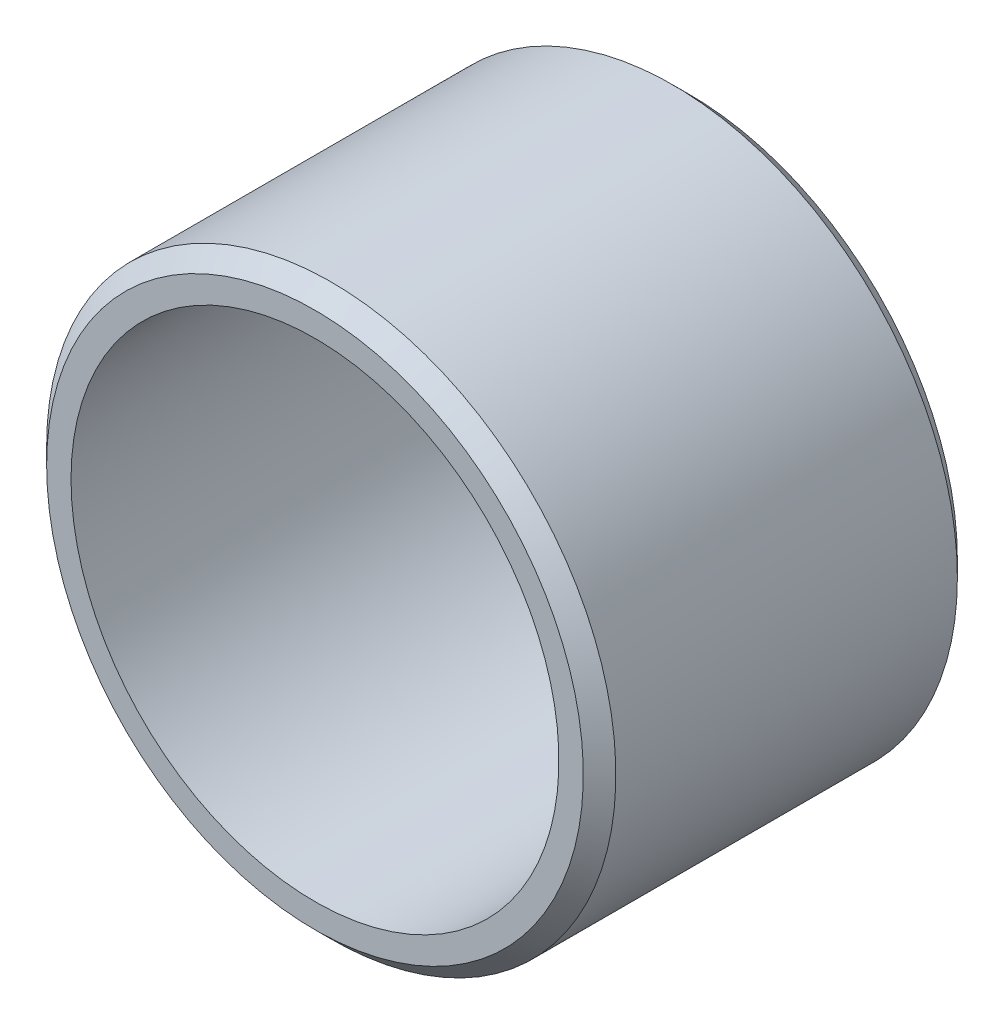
ISO-10303-21;
HEADER;
FILE_DESCRIPTION(('STEP AP214'),'2;1');
FILE_NAME('part.step','',(''),(''),'','','');
FILE_SCHEMA(('AUTOMOTIVE_DESIGN { 1 0 10303 214 1 1 1 1 }'));
ENDSEC;
DATA;
#1=APPLICATION_CONTEXT('core data for automotive mechanical design processes');
#2=APPLICATION_PROTOCOL_DEFINITION('international standard','automotive_design',2000,#1);
#3=PRODUCT_CONTEXT('',#1,'mechanical');
#4=PRODUCT('Part','Part','',(#3));
#5=PRODUCT_RELATED_PRODUCT_CATEGORY('part','',(#4));
#6=PRODUCT_DEFINITION_FORMATION('','',#4);
#7=PRODUCT_DEFINITION_CONTEXT('part definition',#1,'design');
#8=PRODUCT_DEFINITION('design','',#6,#7);
#9=PRODUCT_DEFINITION_SHAPE('','',#8);
#10=(LENGTH_UNIT() NAMED_UNIT(*) SI_UNIT(.MILLI.,.METRE.));
#11=(NAMED_UNIT(*) PLANE_ANGLE_UNIT() SI_UNIT($,.RADIAN.));
#12=(NAMED_UNIT(*) SI_UNIT($,.STERADIAN.) SOLID_ANGLE_UNIT());
#13=UNCERTAINTY_MEASURE_WITH_UNIT(LENGTH_MEASURE(1.E-05),#10,'distance_accuracy_value','');
#14=(GEOMETRIC_REPRESENTATION_CONTEXT(3) GLOBAL_UNCERTAINTY_ASSIGNED_CONTEXT((#13)) GLOBAL_UNIT_ASSIGNED_CONTEXT((#10,
#11,#12)) REPRESENTATION_CONTEXT('',''));
#15=CARTESIAN_POINT('',(0.,0.,0.));
#16=DIRECTION('',(0.,0.,1.));
#17=DIRECTION('',(1.,0.,0.));
#18=AXIS2_PLACEMENT_3D('',#15,#16,#17);
#19=CARTESIAN_POINT('',(0.,0.,23.));
#20=DIRECTION('',(0.,0.,1.));
#21=DIRECTION('',(1.,0.,0.));
#22=AXIS2_PLACEMENT_3D('',#19,#20,#21);
#23=PLANE('',#22);
#24=CARTESIAN_POINT('',(0.,0.,23.));
#25=DIRECTION('',(0.,0.,1.));
#26=DIRECTION('',(1.,0.,0.));
#27=AXIS2_PLACEMENT_3D('',#24,#25,#26);
#28=CIRCLE('',#27,16.5);
#29=CARTESIAN_POINT('',(-16.5,0.,23.));
#30=VERTEX_POINT('',#29);
#31=EDGE_CURVE('E10',#30,#30,#28,.T.);
#32=ORIENTED_EDGE('',*,*,#31,.T.);
#33=EDGE_LOOP('',(#32));
#34=FACE_BOUND('',#33,.T.);
#35=CARTESIAN_POINT('',(0.,0.,23.));
#36=DIRECTION('',(0.,0.,1.));
#37=DIRECTION('',(1.,0.,0.));
#38=AXIS2_PLACEMENT_3D('',#35,#36,#37);
#39=CIRCLE('',#38,15.);
#40=CARTESIAN_POINT('',(-15.,0.,23.));
#41=VERTEX_POINT('',#40);
#42=EDGE_CURVE('E48',#41,#41,#39,.T.);
#43=ORIENTED_EDGE('',*,*,#42,.F.);
#44=EDGE_LOOP('',(#43));
#45=FACE_BOUND('',#44,.T.);
#46=ADVANCED_FACE('F28',(#34,#45),#23,.T.);
#47=CARTESIAN_POINT('',(0.,0.,0.));
#48=DIRECTION('',(0.,0.,1.));
#49=DIRECTION('',(1.,0.,0.));
#50=AXIS2_PLACEMENT_3D('',#47,#48,#49);
#51=PLANE('',#50);
#52=CARTESIAN_POINT('',(0.,0.,0.));
#53=DIRECTION('',(0.,0.,1.));
#54=DIRECTION('',(1.,0.,0.));
#55=AXIS2_PLACEMENT_3D('',#52,#53,#54);
#56=CIRCLE('',#55,16.5);
#57=CARTESIAN_POINT('',(16.5,0.,0.));
#58=VERTEX_POINT('',#57);
#59=EDGE_CURVE('E35',#58,#58,#56,.F.);
#60=ORIENTED_EDGE('',*,*,#59,.T.);
#61=EDGE_LOOP('',(#60));
#62=FACE_BOUND('',#61,.T.);
#63=CARTESIAN_POINT('',(0.,0.,0.));
#64=DIRECTION('',(0.,0.,1.));
#65=DIRECTION('',(1.,0.,0.));
#66=AXIS2_PLACEMENT_3D('',#63,#64,#65);
#67=CIRCLE('',#66,15.);
#68=CARTESIAN_POINT('',(-15.,0.,0.));
#69=VERTEX_POINT('',#68);
#70=EDGE_CURVE('E51',#69,#69,#67,.T.);
#71=ORIENTED_EDGE('',*,*,#70,.T.);
#72=EDGE_LOOP('',(#71));
#73=FACE_BOUND('',#72,.T.);
#74=ADVANCED_FACE('F55',(#62,#73),#51,.F.);
#75=CARTESIAN_POINT('',(0.,0.,23.));
#76=DIRECTION('',(0.,0.,-1.));
#77=DIRECTION('',(-1.,0.,0.));
#78=AXIS2_PLACEMENT_3D('',#75,#76,#77);
#79=CYLINDRICAL_SURFACE('',#78,17.5);
#80=CARTESIAN_POINT('',(0.,0.,1.));
#81=DIRECTION('',(0.,0.,1.));
#82=DIRECTION('',(1.,0.,0.));
#83=AXIS2_PLACEMENT_3D('',#80,#81,#82);
#84=CIRCLE('',#83,17.5);
#85=CARTESIAN_POINT('',(-17.5,0.,1.));
#86=VERTEX_POINT('',#85);
#87=EDGE_CURVE('E39',#86,#86,#84,.T.);
#88=CARTESIAN_POINT('',(0.,0.,22.));
#89=DIRECTION('',(0.,0.,1.));
#90=DIRECTION('',(1.,0.,0.));
#91=AXIS2_PLACEMENT_3D('',#88,#89,#90);
#92=CIRCLE('',#91,17.5);
#93=CARTESIAN_POINT('',(-17.5,0.,22.));
#94=VERTEX_POINT('',#93);
#95=EDGE_CURVE('E43',#94,#94,#92,.F.);
#96=CARTESIAN_POINT('',(-17.5,0.,1.));
#97=CARTESIAN_POINT('',(-17.5,0.,1.21875));
#98=CARTESIAN_POINT('',(-17.5,0.,1.4375));
#99=CARTESIAN_POINT('',(-17.5,0.,1.875));
#100=CARTESIAN_POINT('',(-17.5,0.,2.09375));
#101=CARTESIAN_POINT('',(-17.5,0.,2.53125));
#102=CARTESIAN_POINT('',(-17.5,0.,2.75));
#103=CARTESIAN_POINT('',(-17.5,0.,3.1875));
#104=CARTESIAN_POINT('',(-17.5,0.,3.40625));
#105=CARTESIAN_POINT('',(-17.5,0.,3.84375));
#106=CARTESIAN_POINT('',(-17.5,0.,4.0625));
#107=CARTESIAN_POINT('',(-17.5,0.,4.5));
#108=CARTESIAN_POINT('',(-17.5,0.,4.71875));
#109=CARTESIAN_POINT('',(-17.5,0.,5.15625));
#110=CARTESIAN_POINT('',(-17.5,0.,5.375));
#111=CARTESIAN_POINT('',(-17.5,0.,5.8125));
#112=CARTESIAN_POINT('',(-17.5,0.,6.03125));
#113=CARTESIAN_POINT('',(-17.5,0.,6.46875));
#114=CARTESIAN_POINT('',(-17.5,0.,6.6875));
#115=CARTESIAN_POINT('',(-17.5,0.,7.125));
#116=CARTESIAN_POINT('',(-17.5,0.,7.34375));
#117=CARTESIAN_POINT('',(-17.5,0.,7.78125));
#118=CARTESIAN_POINT('',(-17.5,0.,8.));
#119=CARTESIAN_POINT('',(-17.5,0.,8.4375));
#120=CARTESIAN_POINT('',(-17.5,0.,8.65625));
#121=CARTESIAN_POINT('',(-17.5,0.,9.09375));
#122=CARTESIAN_POINT('',(-17.5,0.,9.3125));
#123=CARTESIAN_POINT('',(-17.5,0.,9.75));
#124=CARTESIAN_POINT('',(-17.5,0.,9.96874999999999));
#125=CARTESIAN_POINT('',(-17.5,0.,10.40625));
#126=CARTESIAN_POINT('',(-17.5,0.,10.625));
#127=CARTESIAN_POINT('',(-17.5,0.,11.0625));
#128=CARTESIAN_POINT('',(-17.5,0.,11.28125));
#129=CARTESIAN_POINT('',(-17.5,0.,11.71875));
#130=CARTESIAN_POINT('',(-17.5,0.,11.9375));
#131=CARTESIAN_POINT('',(-17.5,0.,12.375));
#132=CARTESIAN_POINT('',(-17.5,0.,12.59375));
#133=CARTESIAN_POINT('',(-17.5,0.,13.03125));
#134=CARTESIAN_POINT('',(-17.5,0.,13.25));
#135=CARTESIAN_POINT('',(-17.5,0.,13.6875));
#136=CARTESIAN_POINT('',(-17.5,0.,13.90625));
#137=CARTESIAN_POINT('',(-17.5,0.,14.34375));
#138=CARTESIAN_POINT('',(-17.5,0.,14.5625));
#139=CARTESIAN_POINT('',(-17.5,0.,15.));
#140=CARTESIAN_POINT('',(-17.5,0.,15.21875));
#141=CARTESIAN_POINT('',(-17.5,0.,15.65625));
#142=CARTESIAN_POINT('',(-17.5,0.,15.875));
#143=CARTESIAN_POINT('',(-17.5,0.,16.3125));
#144=CARTESIAN_POINT('',(-17.5,0.,16.53125));
#145=CARTESIAN_POINT('',(-17.5,0.,16.96875));
#146=CARTESIAN_POINT('',(-17.5,0.,17.1875));
#147=CARTESIAN_POINT('',(-17.5,0.,17.625));
#148=CARTESIAN_POINT('',(-17.5,0.,17.84375));
#149=CARTESIAN_POINT('',(-17.5,0.,18.28125));
#150=CARTESIAN_POINT('',(-17.5,0.,18.5));
#151=CARTESIAN_POINT('',(-17.5,0.,18.9375));
#152=CARTESIAN_POINT('',(-17.5,0.,19.15625));
#153=CARTESIAN_POINT('',(-17.5,0.,19.59375));
#154=CARTESIAN_POINT('',(-17.5,0.,19.8125));
#155=CARTESIAN_POINT('',(-17.5,0.,20.25));
#156=CARTESIAN_POINT('',(-17.5,0.,20.46875));
#157=CARTESIAN_POINT('',(-17.5,0.,20.90625));
#158=CARTESIAN_POINT('',(-17.5,0.,21.125));
#159=CARTESIAN_POINT('',(-17.5,0.,21.5625));
#160=CARTESIAN_POINT('',(-17.5,0.,21.78125));
#161=CARTESIAN_POINT('',(-17.5,0.,22.));
#162=B_SPLINE_CURVE_WITH_KNOTS('',3,(#96,#97,#98,#99,#100,#101,#102,#103,#104,#105,#106,#107,
#108,#109,#110,#111,#112,#113,#114,#115,#116,#117,#118,#119,#120,#121,#122,#123,#124,#125,#126,
#127,#128,#129,#130,#131,#132,#133,#134,#135,#136,#137,#138,#139,#140,#141,#142,#143,#144,#145,
#146,#147,#148,#149,#150,#151,#152,#153,#154,#155,#156,#157,#158,#159,#160,#161),.UNSPECIFIED.,
.F.,.F.,(4,2,2,2,2,2,2,2,2,2,2,2,2,2,2,2,2,2,2,2,2,2,2,2,2,2,2,2,2,2,2,2,4),(0.,
0.656250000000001,1.3125,1.96875,2.625,3.28125,3.9375,4.59374999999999,5.24999999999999,
5.90624999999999,6.56249999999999,7.21874999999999,7.87499999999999,8.53124999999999,
9.18749999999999,9.84374999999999,10.5,11.15625,11.8125,12.46875,13.125,13.78125,14.4375,
15.09375,15.75,16.40625,17.0625,17.71875,18.375,19.03125,19.6875,20.34375,21.),.UNSPECIFIED.);
#163=EDGE_CURVE('BSEAM30',#86,#94,#162,.T.);
#164=ORIENTED_EDGE('',*,*,#87,.T.);
#165=ORIENTED_EDGE('',*,*,#95,.T.);
#166=ORIENTED_EDGE('',*,*,#163,.T.);
#167=ORIENTED_EDGE('',*,*,#163,.F.);
#168=EDGE_LOOP('',(#164,#166,#165,#167));
#169=FACE_BOUND('',#168,.T.);
#170=ADVANCED_FACE('F30',(#169),#79,.T.);
#171=CARTESIAN_POINT('',(0.,0.,23.));
#172=DIRECTION('',(0.,0.,-1.));
#173=DIRECTION('',(-1.,0.,0.));
#174=AXIS2_PLACEMENT_3D('',#171,#172,#173);
#175=CYLINDRICAL_SURFACE('',#174,15.);
#176=CARTESIAN_POINT('',(-15.,0.,23.));
#177=CARTESIAN_POINT('',(-15.,0.,22.7604166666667));
#178=CARTESIAN_POINT('',(-15.,0.,22.5208333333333));
#179=CARTESIAN_POINT('',(-15.,0.,22.0416666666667));
#180=CARTESIAN_POINT('',(-15.,0.,21.8020833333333));
#181=CARTESIAN_POINT('',(-15.,0.,21.3229166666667));
#182=CARTESIAN_POINT('',(-15.,0.,21.0833333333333));
#183=CARTESIAN_POINT('',(-15.,0.,20.6041666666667));
#184=CARTESIAN_POINT('',(-15.,0.,20.3645833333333));
#185=CARTESIAN_POINT('',(-15.,0.,19.8854166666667));
#186=CARTESIAN_POINT('',(-15.,0.,19.6458333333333));
#187=CARTESIAN_POINT('',(-15.,0.,19.1666666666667));
#188=CARTESIAN_POINT('',(-15.,0.,18.9270833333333));
#189=CARTESIAN_POINT('',(-15.,0.,18.4479166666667));
#190=CARTESIAN_POINT('',(-15.,0.,18.2083333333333));
#191=CARTESIAN_POINT('',(-15.,0.,17.7291666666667));
#192=CARTESIAN_POINT('',(-15.,0.,17.4895833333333));
#193=CARTESIAN_POINT('',(-15.,0.,17.0104166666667));
#194=CARTESIAN_POINT('',(-15.,0.,16.7708333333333));
#195=CARTESIAN_POINT('',(-15.,0.,16.2916666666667));
#196=CARTESIAN_POINT('',(-15.,0.,16.0520833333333));
#197=CARTESIAN_POINT('',(-15.,0.,15.5729166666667));
#198=CARTESIAN_POINT('',(-15.,0.,15.3333333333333));
#199=CARTESIAN_POINT('',(-15.,0.,14.8541666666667));
#200=CARTESIAN_POINT('',(-15.,0.,14.6145833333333));
#201=CARTESIAN_POINT('',(-15.,0.,14.1354166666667));
#202=CARTESIAN_POINT('',(-15.,0.,13.8958333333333));
#203=CARTESIAN_POINT('',(-15.,0.,13.4166666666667));
#204=CARTESIAN_POINT('',(-15.,0.,13.1770833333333));
#205=CARTESIAN_POINT('',(-15.,0.,12.6979166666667));
#206=CARTESIAN_POINT('',(-15.,0.,12.4583333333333));
#207=CARTESIAN_POINT('',(-15.,0.,11.9791666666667));
#208=CARTESIAN_POINT('',(-15.,0.,11.7395833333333));
#209=CARTESIAN_POINT('',(-15.,0.,11.2604166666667));
#210=CARTESIAN_POINT('',(-15.,0.,11.0208333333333));
#211=CARTESIAN_POINT('',(-15.,0.,10.5416666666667));
#212=CARTESIAN_POINT('',(-15.,0.,10.3020833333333));
#213=CARTESIAN_POINT('',(-15.,0.,9.82291666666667));
#214=CARTESIAN_POINT('',(-15.,0.,9.58333333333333));
#215=CARTESIAN_POINT('',(-15.,0.,9.10416666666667));
#216=CARTESIAN_POINT('',(-15.,0.,8.86458333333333));
#217=CARTESIAN_POINT('',(-15.,0.,8.38541666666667));
#218=CARTESIAN_POINT('',(-15.,0.,8.14583333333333));
#219=CARTESIAN_POINT('',(-15.,0.,7.66666666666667));
#220=CARTESIAN_POINT('',(-15.,0.,7.42708333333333));
#221=CARTESIAN_POINT('',(-15.,0.,6.94791666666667));
#222=CARTESIAN_POINT('',(-15.,0.,6.70833333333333));
#223=CARTESIAN_POINT('',(-15.,0.,6.22916666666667));
#224=CARTESIAN_POINT('',(-15.,0.,5.98958333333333));
#225=CARTESIAN_POINT('',(-15.,0.,5.51041666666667));
#226=CARTESIAN_POINT('',(-15.,0.,5.27083333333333));
#227=CARTESIAN_POINT('',(-15.,0.,4.79166666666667));
#228=CARTESIAN_POINT('',(-15.,0.,4.55208333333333));
#229=CARTESIAN_POINT('',(-15.,0.,4.07291666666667));
#230=CARTESIAN_POINT('',(-15.,0.,3.83333333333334));
#231=CARTESIAN_POINT('',(-15.,0.,3.35416666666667));
#232=CARTESIAN_POINT('',(-15.,0.,3.11458333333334));
#233=CARTESIAN_POINT('',(-15.,0.,2.63541666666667));
#234=CARTESIAN_POINT('',(-15.,0.,2.39583333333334));
#235=CARTESIAN_POINT('',(-15.,0.,1.91666666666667));
#236=CARTESIAN_POINT('',(-15.,0.,1.67708333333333));
#237=CARTESIAN_POINT('',(-15.,0.,1.19791666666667));
#238=CARTESIAN_POINT('',(-15.,0.,0.958333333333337));
#239=CARTESIAN_POINT('',(-15.,0.,0.479166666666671));
#240=CARTESIAN_POINT('',(-15.,0.,0.239583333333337));
#241=CARTESIAN_POINT('',(-15.,0.,0.));
#242=B_SPLINE_CURVE_WITH_KNOTS('',3,(#176,#177,#178,#179,#180,#181,#182,#183,#184,#185,#186,
#187,#188,#189,#190,#191,#192,#193,#194,#195,#196,#197,#198,#199,#200,#201,#202,#203,#204,#205,
#206,#207,#208,#209,#210,#211,#212,#213,#214,#215,#216,#217,#218,#219,#220,#221,#222,#223,#224,
#225,#226,#227,#228,#229,#230,#231,#232,#233,#234,#235,#236,#237,#238,#239,#240,#241),
.UNSPECIFIED.,.F.,.F.,(4,2,2,2,2,2,2,2,2,2,2,2,2,2,2,2,2,2,2,2,2,2,2,2,2,2,2,2,2,2,2,2,4),(0.,
0.718749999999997,1.4375,2.15625,2.875,3.59375,4.31249999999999,5.03124999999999,
5.74999999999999,6.46874999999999,7.18749999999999,7.90624999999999,8.62499999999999,
9.34374999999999,10.0625,10.78125,11.5,12.21875,12.9375,13.65625,14.375,15.09375,15.8125,
16.53125,17.25,17.96875,18.6875,19.40625,20.125,20.84375,21.5625,22.28125,23.),.UNSPECIFIED.);
#243=EDGE_CURVE('BSEAM57',#41,#69,#242,.T.);
#244=ORIENTED_EDGE('',*,*,#42,.T.);
#245=ORIENTED_EDGE('',*,*,#70,.F.);
#246=ORIENTED_EDGE('',*,*,#243,.T.);
#247=ORIENTED_EDGE('',*,*,#243,.F.);
#248=EDGE_LOOP('',(#244,#246,#245,#247));
#249=FACE_BOUND('',#248,.T.);
#250=ADVANCED_FACE('F57',(#249),#175,.F.);
#251=CARTESIAN_POINT('',(0.,0.,1.));
#252=DIRECTION('',(0.,0.,1.));
#253=DIRECTION('',(1.,0.,0.));
#254=AXIS2_PLACEMENT_3D('',#251,#252,#253);
#255=CONICAL_SURFACE('',#254,17.5,0.78539816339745);
#256=ORIENTED_EDGE('',*,*,#59,.F.);
#257=EDGE_LOOP('',(#256));
#258=FACE_BOUND('',#257,.T.);
#259=ORIENTED_EDGE('',*,*,#87,.F.);
#260=EDGE_LOOP('',(#259));
#261=FACE_BOUND('',#260,.T.);
#262=ADVANCED_FACE('F59',(#258,#261),#255,.T.);
#263=CARTESIAN_POINT('',(0.,0.,23.));
#264=DIRECTION('',(0.,0.,-1.));
#265=DIRECTION('',(-1.,0.,0.));
#266=AXIS2_PLACEMENT_3D('',#263,#264,#265);
#267=CONICAL_SURFACE('',#266,16.5,0.785398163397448);
#268=CARTESIAN_POINT('',(-17.5,0.,22.));
#269=CARTESIAN_POINT('',(-17.4895833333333,0.,22.0104166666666));
#270=CARTESIAN_POINT('',(-17.4791666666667,0.,22.0208333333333));
#271=CARTESIAN_POINT('',(-17.4583333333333,0.,22.0416666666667));
#272=CARTESIAN_POINT('',(-17.4479166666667,0.,22.0520833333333));
#273=CARTESIAN_POINT('',(-17.4270833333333,0.,22.0729166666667));
#274=CARTESIAN_POINT('',(-17.4166666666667,0.,22.0833333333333));
#275=CARTESIAN_POINT('',(-17.3958333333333,0.,22.1041666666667));
#276=CARTESIAN_POINT('',(-17.3854166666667,0.,22.1145833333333));
#277=CARTESIAN_POINT('',(-17.3645833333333,0.,22.1354166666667));
#278=CARTESIAN_POINT('',(-17.3541666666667,0.,22.1458333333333));
#279=CARTESIAN_POINT('',(-17.3333333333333,0.,22.1666666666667));
#280=CARTESIAN_POINT('',(-17.3229166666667,0.,22.1770833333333));
#281=CARTESIAN_POINT('',(-17.3020833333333,0.,22.1979166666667));
#282=CARTESIAN_POINT('',(-17.2916666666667,0.,22.2083333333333));
#283=CARTESIAN_POINT('',(-17.2708333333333,0.,22.2291666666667));
#284=CARTESIAN_POINT('',(-17.2604166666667,0.,22.2395833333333));
#285=CARTESIAN_POINT('',(-17.2395833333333,0.,22.2604166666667));
#286=CARTESIAN_POINT('',(-17.2291666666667,0.,22.2708333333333));
#287=CARTESIAN_POINT('',(-17.2083333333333,0.,22.2916666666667));
#288=CARTESIAN_POINT('',(-17.1979166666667,0.,22.3020833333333));
#289=CARTESIAN_POINT('',(-17.1770833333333,0.,22.3229166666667));
#290=CARTESIAN_POINT('',(-17.1666666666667,0.,22.3333333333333));
#291=CARTESIAN_POINT('',(-17.1458333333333,0.,22.3541666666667));
#292=CARTESIAN_POINT('',(-17.1354166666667,0.,22.3645833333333));
#293=CARTESIAN_POINT('',(-17.1145833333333,0.,22.3854166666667));
#294=CARTESIAN_POINT('',(-17.1041666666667,0.,22.3958333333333));
#295=CARTESIAN_POINT('',(-17.0833333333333,0.,22.4166666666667));
#296=CARTESIAN_POINT('',(-17.0729166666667,0.,22.4270833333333));
#297=CARTESIAN_POINT('',(-17.0520833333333,0.,22.4479166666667));
#298=CARTESIAN_POINT('',(-17.0416666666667,0.,22.4583333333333));
#299=CARTESIAN_POINT('',(-17.0208333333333,0.,22.4791666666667));
#300=CARTESIAN_POINT('',(-17.0104166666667,0.,22.4895833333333));
#301=CARTESIAN_POINT('',(-16.9895833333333,0.,22.5104166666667));
#302=CARTESIAN_POINT('',(-16.9791666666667,0.,22.5208333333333));
#303=CARTESIAN_POINT('',(-16.9583333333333,0.,22.5416666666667));
#304=CARTESIAN_POINT('',(-16.9479166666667,0.,22.5520833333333));
#305=CARTESIAN_POINT('',(-16.9270833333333,0.,22.5729166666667));
#306=CARTESIAN_POINT('',(-16.9166666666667,0.,22.5833333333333));
#307=CARTESIAN_POINT('',(-16.8958333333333,0.,22.6041666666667));
#308=CARTESIAN_POINT('',(-16.8854166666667,0.,22.6145833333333));
#309=CARTESIAN_POINT('',(-16.8645833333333,0.,22.6354166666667));
#310=CARTESIAN_POINT('',(-16.8541666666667,0.,22.6458333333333));
#311=CARTESIAN_POINT('',(-16.8333333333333,0.,22.6666666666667));
#312=CARTESIAN_POINT('',(-16.8229166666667,0.,22.6770833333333));
#313=CARTESIAN_POINT('',(-16.8020833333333,0.,22.6979166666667));
#314=CARTESIAN_POINT('',(-16.7916666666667,0.,22.7083333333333));
#315=CARTESIAN_POINT('',(-16.7708333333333,0.,22.7291666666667));
#316=CARTESIAN_POINT('',(-16.7604166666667,0.,22.7395833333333));
#317=CARTESIAN_POINT('',(-16.7395833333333,0.,22.7604166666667));
#318=CARTESIAN_POINT('',(-16.7291666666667,0.,22.7708333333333));
#319=CARTESIAN_POINT('',(-16.7083333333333,0.,22.7916666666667));
#320=CARTESIAN_POINT('',(-16.6979166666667,0.,22.8020833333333));
#321=CARTESIAN_POINT('',(-16.6770833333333,0.,22.8229166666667));
#322=CARTESIAN_POINT('',(-16.6666666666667,0.,22.8333333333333));
#323=CARTESIAN_POINT('',(-16.6458333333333,0.,22.8541666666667));
#324=CARTESIAN_POINT('',(-16.6354166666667,0.,22.8645833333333));
#325=CARTESIAN_POINT('',(-16.6145833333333,0.,22.8854166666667));
#326=CARTESIAN_POINT('',(-16.6041666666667,0.,22.8958333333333));
#327=CARTESIAN_POINT('',(-16.5833333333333,0.,22.9166666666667));
#328=CARTESIAN_POINT('',(-16.5729166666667,0.,22.9270833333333));
#329=CARTESIAN_POINT('',(-16.5520833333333,0.,22.9479166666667));
#330=CARTESIAN_POINT('',(-16.5416666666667,0.,22.9583333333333));
#331=CARTESIAN_POINT('',(-16.5208333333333,0.,22.9791666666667));
#332=CARTESIAN_POINT('',(-16.5104166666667,0.,22.9895833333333));
#333=CARTESIAN_POINT('',(-16.5,0.,23.));
#334=B_SPLINE_CURVE_WITH_KNOTS('',3,(#268,#269,#270,#271,#272,#273,#274,#275,#276,#277,#278,
#279,#280,#281,#282,#283,#284,#285,#286,#287,#288,#289,#290,#291,#292,#293,#294,#295,#296,#297,
#298,#299,#300,#301,#302,#303,#304,#305,#306,#307,#308,#309,#310,#311,#312,#313,#314,#315,#316,
#317,#318,#319,#320,#321,#322,#323,#324,#325,#326,#327,#328,#329,#330,#331,#332,#333),
.UNSPECIFIED.,.F.,.F.,(4,2,2,2,2,2,2,2,2,2,2,2,2,2,2,2,2,2,2,2,2,2,2,2,2,2,2,2,2,2,2,2,4),(0.,
0.0441941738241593,0.0883883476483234,0.132582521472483,0.176776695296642,0.220970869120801,
0.26516504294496,0.30935921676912,0.353553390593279,0.397747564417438,0.441941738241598,
0.486135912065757,0.530330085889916,0.574524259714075,0.618718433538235,0.662912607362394,
0.707106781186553,0.751300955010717,0.795495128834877,0.839689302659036,0.883883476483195,
0.928077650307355,0.972271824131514,1.01646599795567,1.06066017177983,1.10485434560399,
1.14904851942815,1.19324269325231,1.23743686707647,1.28163104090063,1.32582521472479,
1.37001938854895,1.41421356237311),.UNSPECIFIED.);
#335=EDGE_CURVE('BSEAM65',#94,#30,#334,.T.);
#336=ORIENTED_EDGE('',*,*,#95,.F.);
#337=ORIENTED_EDGE('',*,*,#31,.F.);
#338=ORIENTED_EDGE('',*,*,#335,.T.);
#339=ORIENTED_EDGE('',*,*,#335,.F.);
#340=EDGE_LOOP('',(#336,#338,#337,#339));
#341=FACE_BOUND('',#340,.T.);
#342=ADVANCED_FACE('F65',(#341),#267,.T.);
#343=CLOSED_SHELL('',(#46,#74,#170,#250,#262,#342));
#344=MANIFOLD_SOLID_BREP('B2',#343);
#345=ADVANCED_BREP_SHAPE_REPRESENTATION('',(#18,#344),#14);
#346=SHAPE_DEFINITION_REPRESENTATION(#9,#345);
ENDSEC;
END-ISO-10303-21;
